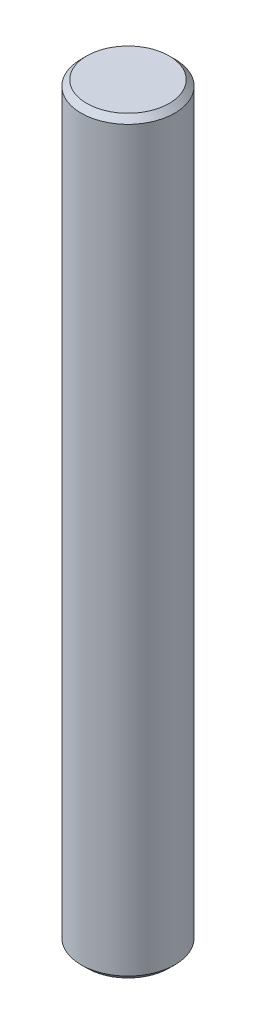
from build123d import *

# Parameters (mm, degrees)
SKETCH1_R      = 6.35254
EXTRUDE1_DEPTH = 50.8
CHAMFER1_SIZE  = 0.762


with BuildPart() as part:
    # Sketch1 → Extrude1 (new, symmetric)
    with BuildSketch(Plane(origin=(0, 0, 0), x_dir=(1, 0, 0), z_dir=(0, 1, 0))):
        with Locations(Location((0, 0, 0), (0, 0, 270))):
            Circle(SKETCH1_R)
    extrude(amount=EXTRUDE1_DEPTH, both=True)

    # Chamfer1
    chamfer1_edges = [part.edges().sort_by_distance(p)[0] for p in [
        (0, -50.8, -6.35254),
        (0, 50.8, -6.35254),
    ]]
    chamfer(chamfer1_edges, length=CHAMFER1_SIZE)


solid = part.part
